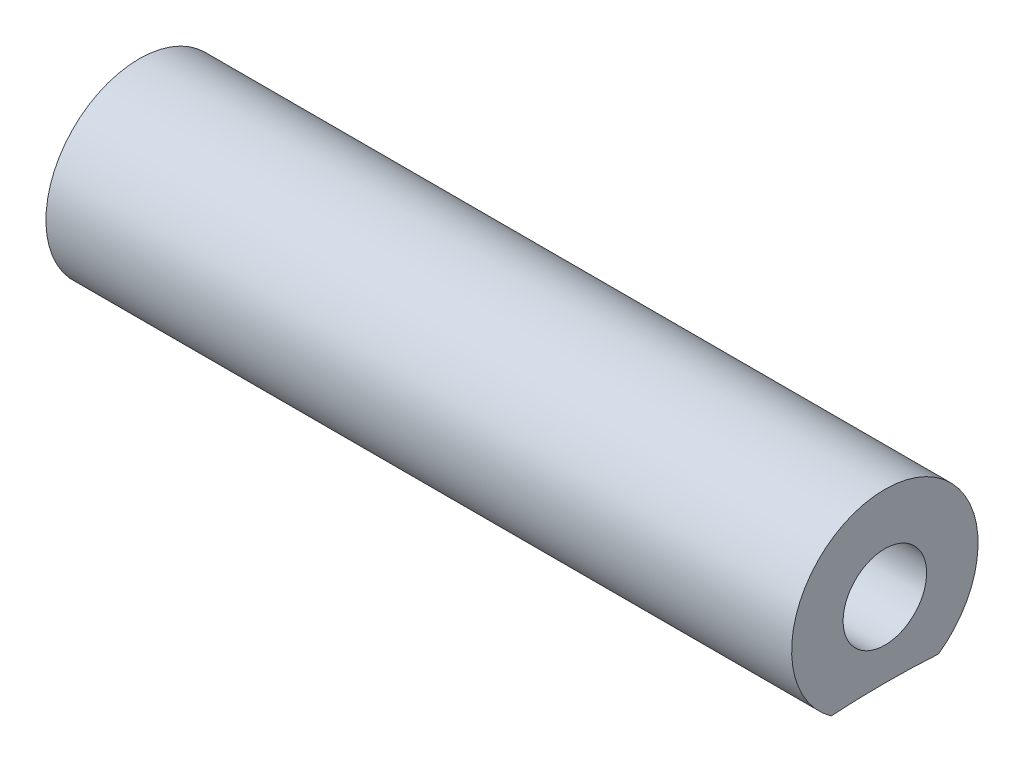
ISO-10303-21;
HEADER;
FILE_DESCRIPTION(('STEP AP214'),'2;1');
FILE_NAME('part.step','',(''),(''),'','','');
FILE_SCHEMA(('AUTOMOTIVE_DESIGN { 1 0 10303 214 1 1 1 1 }'));
ENDSEC;
DATA;
#1=APPLICATION_CONTEXT('core data for automotive mechanical design processes');
#2=APPLICATION_PROTOCOL_DEFINITION('international standard','automotive_design',2000,#1);
#3=PRODUCT_CONTEXT('',#1,'mechanical');
#4=PRODUCT('Part','Part','',(#3));
#5=PRODUCT_RELATED_PRODUCT_CATEGORY('part','',(#4));
#6=PRODUCT_DEFINITION_FORMATION('','',#4);
#7=PRODUCT_DEFINITION_CONTEXT('part definition',#1,'design');
#8=PRODUCT_DEFINITION('design','',#6,#7);
#9=PRODUCT_DEFINITION_SHAPE('','',#8);
#10=(LENGTH_UNIT() NAMED_UNIT(*) SI_UNIT(.MILLI.,.METRE.));
#11=(NAMED_UNIT(*) PLANE_ANGLE_UNIT() SI_UNIT($,.RADIAN.));
#12=(NAMED_UNIT(*) SI_UNIT($,.STERADIAN.) SOLID_ANGLE_UNIT());
#13=UNCERTAINTY_MEASURE_WITH_UNIT(LENGTH_MEASURE(1.E-05),#10,'distance_accuracy_value','');
#14=(GEOMETRIC_REPRESENTATION_CONTEXT(3) GLOBAL_UNCERTAINTY_ASSIGNED_CONTEXT((#13)) GLOBAL_UNIT_ASSIGNED_CONTEXT((#10,
#11,#12)) REPRESENTATION_CONTEXT('',''));
#15=CARTESIAN_POINT('',(0.,0.,0.));
#16=DIRECTION('',(0.,0.,1.));
#17=DIRECTION('',(1.,0.,0.));
#18=AXIS2_PLACEMENT_3D('',#15,#16,#17);
#19=CARTESIAN_POINT('',(25.4,0.,0.));
#20=DIRECTION('',(-1.,0.,0.));
#21=DIRECTION('',(0.,0.,1.));
#22=AXIS2_PLACEMENT_3D('',#19,#20,#21);
#23=CYLINDRICAL_SURFACE('',#22,3.175);
#24=CARTESIAN_POINT('',(0.,0.,0.));
#25=DIRECTION('',(1.,0.,0.));
#26=DIRECTION('',(0.,0.,-1.));
#27=AXIS2_PLACEMENT_3D('',#24,#25,#26);
#28=CIRCLE('',#27,3.175);
#29=CARTESIAN_POINT('',(0.,-2.59737951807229,-1.8259914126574));
#30=VERTEX_POINT('',#29);
#31=CARTESIAN_POINT('',(0.,-2.59737951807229,1.8259914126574));
#32=VERTEX_POINT('',#31);
#33=EDGE_CURVE('E38',#30,#32,#28,.T.);
#34=ORIENTED_EDGE('',*,*,#33,.T.);
#35=DIRECTION('',(-1.,0.,0.));
#36=VECTOR('',#35,1.);
#37=CARTESIAN_POINT('',(12.7,-2.59737951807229,1.8259914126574));
#38=LINE('',#37,#36);
#39=CARTESIAN_POINT('',(25.4,-2.59737951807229,1.8259914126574));
#40=VERTEX_POINT('',#39);
#41=EDGE_CURVE('E45',#32,#40,#38,.F.);
#42=ORIENTED_EDGE('',*,*,#41,.T.);
#43=CARTESIAN_POINT('',(25.4,0.,0.));
#44=DIRECTION('',(1.,0.,0.));
#45=DIRECTION('',(0.,0.,-1.));
#46=AXIS2_PLACEMENT_3D('',#43,#44,#45);
#47=CIRCLE('',#46,3.175);
#48=CARTESIAN_POINT('',(25.4,-2.59737951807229,-1.8259914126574));
#49=VERTEX_POINT('',#48);
#50=EDGE_CURVE('E11',#49,#40,#47,.T.);
#51=ORIENTED_EDGE('',*,*,#50,.F.);
#52=DIRECTION('',(-1.,0.,0.));
#53=VECTOR('',#52,1.);
#54=CARTESIAN_POINT('',(12.7,-2.59737951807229,-1.8259914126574));
#55=LINE('',#54,#53);
#56=EDGE_CURVE('E57',#49,#30,#55,.T.);
#57=ORIENTED_EDGE('',*,*,#56,.T.);
#58=EDGE_LOOP('',(#34,#42,#51,#57));
#59=FACE_BOUND('',#58,.T.);
#60=ADVANCED_FACE('F31',(#59),#23,.T.);
#61=CARTESIAN_POINT('',(25.4,0.,0.));
#62=DIRECTION('',(1.,0.,0.));
#63=DIRECTION('',(0.,0.,-1.));
#64=AXIS2_PLACEMENT_3D('',#61,#62,#63);
#65=PLANE('',#64);
#66=CARTESIAN_POINT('',(25.4,0.,0.));
#67=DIRECTION('',(-1.,0.,0.));
#68=DIRECTION('',(0.,0.,1.));
#69=AXIS2_PLACEMENT_3D('',#66,#67,#68);
#70=CIRCLE('',#69,1.42239999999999);
#71=CARTESIAN_POINT('',(25.4,0.,1.42239999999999));
#72=VERTEX_POINT('',#71);
#73=EDGE_CURVE('E86',#72,#72,#70,.T.);
#74=ORIENTED_EDGE('',*,*,#73,.T.);
#75=EDGE_LOOP('',(#74));
#76=FACE_BOUND('',#75,.T.);
#77=CARTESIAN_POINT('',(25.4,-31.623,0.));
#78=DIRECTION('',(-1.,0.,0.));
#79=DIRECTION('',(0.,0.,1.));
#80=AXIS2_PLACEMENT_3D('',#77,#78,#79);
#81=CIRCLE('',#80,29.083);
#82=EDGE_CURVE('E55',#40,#49,#81,.T.);
#83=ORIENTED_EDGE('',*,*,#82,.T.);
#84=ORIENTED_EDGE('',*,*,#50,.T.);
#85=EDGE_LOOP('',(#83,#84));
#86=FACE_BOUND('',#85,.T.);
#87=ADVANCED_FACE('F65',(#76,#86),#65,.T.);
#88=CARTESIAN_POINT('',(0.,0.,0.));
#89=DIRECTION('',(1.,0.,0.));
#90=DIRECTION('',(0.,0.,-1.));
#91=AXIS2_PLACEMENT_3D('',#88,#89,#90);
#92=PLANE('',#91);
#93=CARTESIAN_POINT('',(0.,0.,0.));
#94=DIRECTION('',(-1.,0.,0.));
#95=DIRECTION('',(0.,0.,1.));
#96=AXIS2_PLACEMENT_3D('',#93,#94,#95);
#97=CIRCLE('',#96,1.4224);
#98=CARTESIAN_POINT('',(0.,0.,1.4224));
#99=VERTEX_POINT('',#98);
#100=EDGE_CURVE('E89',#99,#99,#97,.T.);
#101=ORIENTED_EDGE('',*,*,#100,.F.);
#102=EDGE_LOOP('',(#101));
#103=FACE_BOUND('',#102,.T.);
#104=ORIENTED_EDGE('',*,*,#33,.F.);
#105=CARTESIAN_POINT('',(0.,-31.623,0.));
#106=DIRECTION('',(-1.,0.,0.));
#107=DIRECTION('',(0.,0.,1.));
#108=AXIS2_PLACEMENT_3D('',#105,#106,#107);
#109=CIRCLE('',#108,29.083);
#110=EDGE_CURVE('E49',#32,#30,#109,.T.);
#111=ORIENTED_EDGE('',*,*,#110,.F.);
#112=EDGE_LOOP('',(#104,#111));
#113=FACE_BOUND('',#112,.T.);
#114=ADVANCED_FACE('F67',(#103,#113),#92,.F.);
#115=CARTESIAN_POINT('',(25.4,-31.623,0.));
#116=DIRECTION('',(-1.,0.,0.));
#117=DIRECTION('',(0.,0.,1.));
#118=AXIS2_PLACEMENT_3D('',#115,#116,#117);
#119=CYLINDRICAL_SURFACE('',#118,29.083);
#120=ORIENTED_EDGE('',*,*,#110,.T.);
#121=ORIENTED_EDGE('',*,*,#56,.F.);
#122=ORIENTED_EDGE('',*,*,#82,.F.);
#123=ORIENTED_EDGE('',*,*,#41,.F.);
#124=EDGE_LOOP('',(#120,#121,#122,#123));
#125=FACE_BOUND('',#124,.T.);
#126=ADVANCED_FACE('F56',(#125),#119,.F.);
#127=CARTESIAN_POINT('',(0.,0.,0.));
#128=DIRECTION('',(-1.,0.,0.));
#129=DIRECTION('',(0.,0.,1.));
#130=AXIS2_PLACEMENT_3D('',#127,#128,#129);
#131=CYLINDRICAL_SURFACE('',#130,1.4224);
#132=ORIENTED_EDGE('',*,*,#73,.F.);
#133=EDGE_LOOP('',(#132));
#134=FACE_BOUND('',#133,.T.);
#135=ORIENTED_EDGE('',*,*,#100,.T.);
#136=EDGE_LOOP('',(#135));
#137=FACE_BOUND('',#136,.T.);
#138=ADVANCED_FACE('F79',(#134,#137),#131,.F.);
#139=CLOSED_SHELL('',(#60,#87,#114,#126,#138));
#140=MANIFOLD_SOLID_BREP('B2',#139);
#141=ADVANCED_BREP_SHAPE_REPRESENTATION('',(#18,#140),#14);
#142=SHAPE_DEFINITION_REPRESENTATION(#9,#141);
ENDSEC;
END-ISO-10303-21;
